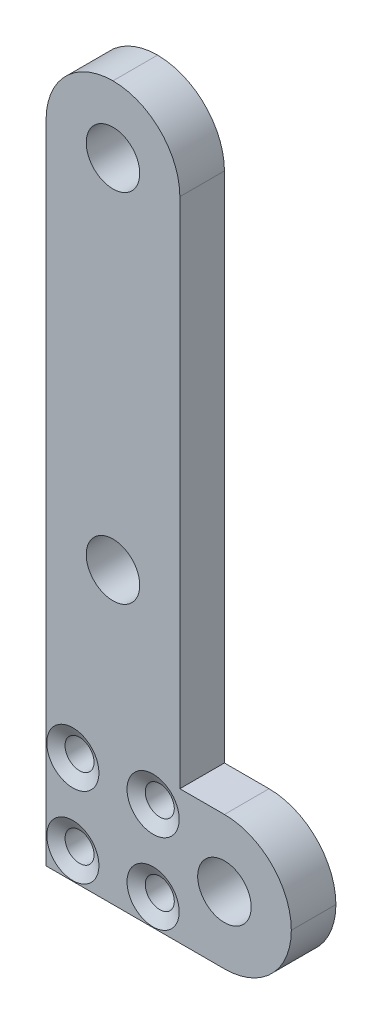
ISO-10303-21;
HEADER;
FILE_DESCRIPTION(('STEP AP214'),'2;1');
FILE_NAME('part.step','',(''),(''),'','','');
FILE_SCHEMA(('AUTOMOTIVE_DESIGN { 1 0 10303 214 1 1 1 1 }'));
ENDSEC;
DATA;
#1=APPLICATION_CONTEXT('core data for automotive mechanical design processes');
#2=APPLICATION_PROTOCOL_DEFINITION('international standard','automotive_design',2000,#1);
#3=PRODUCT_CONTEXT('',#1,'mechanical');
#4=PRODUCT('Part','Part','',(#3));
#5=PRODUCT_RELATED_PRODUCT_CATEGORY('part','',(#4));
#6=PRODUCT_DEFINITION_FORMATION('','',#4);
#7=PRODUCT_DEFINITION_CONTEXT('part definition',#1,'design');
#8=PRODUCT_DEFINITION('design','',#6,#7);
#9=PRODUCT_DEFINITION_SHAPE('','',#8);
#10=(LENGTH_UNIT() NAMED_UNIT(*) SI_UNIT(.MILLI.,.METRE.));
#11=(NAMED_UNIT(*) PLANE_ANGLE_UNIT() SI_UNIT($,.RADIAN.));
#12=(NAMED_UNIT(*) SI_UNIT($,.STERADIAN.) SOLID_ANGLE_UNIT());
#13=UNCERTAINTY_MEASURE_WITH_UNIT(LENGTH_MEASURE(1.E-05),#10,'distance_accuracy_value','');
#14=(GEOMETRIC_REPRESENTATION_CONTEXT(3) GLOBAL_UNCERTAINTY_ASSIGNED_CONTEXT((#13)) GLOBAL_UNIT_ASSIGNED_CONTEXT((#10,
#11,#12)) REPRESENTATION_CONTEXT('',''));
#15=CARTESIAN_POINT('',(0.,0.,0.));
#16=DIRECTION('',(0.,0.,1.));
#17=DIRECTION('',(1.,0.,0.));
#18=AXIS2_PLACEMENT_3D('',#15,#16,#17);
#19=CARTESIAN_POINT('',(-30.,0.,10.));
#20=DIRECTION('',(1.,0.,0.));
#21=DIRECTION('',(0.,1.,0.));
#22=AXIS2_PLACEMENT_3D('',#19,#20,#21);
#23=PLANE('',#22);
#24=DIRECTION('',(0.,-1.,0.));
#25=VECTOR('',#24,1.);
#26=CARTESIAN_POINT('',(-30.,0.,10.));
#27=LINE('',#26,#25);
#28=CARTESIAN_POINT('',(-30.,-15.,10.));
#29=VERTEX_POINT('',#28);
#30=CARTESIAN_POINT('',(-30.,-160.,10.));
#31=VERTEX_POINT('',#30);
#32=EDGE_CURVE('E102',#29,#31,#27,.T.);
#33=ORIENTED_EDGE('',*,*,#32,.F.);
#34=DIRECTION('',(0.,0.,-1.));
#35=VECTOR('',#34,1.);
#36=CARTESIAN_POINT('',(-30.,-15.,10.));
#37=LINE('',#36,#35);
#38=CARTESIAN_POINT('',(-30.,-15.,0.));
#39=VERTEX_POINT('',#38);
#40=EDGE_CURVE('E151',#29,#39,#37,.T.);
#41=ORIENTED_EDGE('',*,*,#40,.T.);
#42=DIRECTION('',(0.,-1.,0.));
#43=VECTOR('',#42,1.);
#44=CARTESIAN_POINT('',(-30.,0.,0.));
#45=LINE('',#44,#43);
#46=CARTESIAN_POINT('',(-30.,-160.,0.));
#47=VERTEX_POINT('',#46);
#48=EDGE_CURVE('E125',#39,#47,#45,.T.);
#49=ORIENTED_EDGE('',*,*,#48,.T.);
#50=DIRECTION('',(0.,0.,-1.));
#51=VECTOR('',#50,1.);
#52=CARTESIAN_POINT('',(-30.,-160.,10.));
#53=LINE('',#52,#51);
#54=EDGE_CURVE('E119',#31,#47,#53,.T.);
#55=ORIENTED_EDGE('',*,*,#54,.F.);
#56=EDGE_LOOP('',(#33,#41,#49,#55));
#57=FACE_BOUND('',#56,.T.);
#58=ADVANCED_FACE('F36',(#57),#23,.F.);
#59=CARTESIAN_POINT('',(25.,-160.,10.));
#60=DIRECTION('',(0.,1.,0.));
#61=DIRECTION('',(0.,0.,1.));
#62=AXIS2_PLACEMENT_3D('',#59,#60,#61);
#63=PLANE('',#62);
#64=DIRECTION('',(1.,0.,0.));
#65=VECTOR('',#64,1.);
#66=CARTESIAN_POINT('',(25.,-160.,0.));
#67=LINE('',#66,#65);
#68=CARTESIAN_POINT('',(10.,-160.,0.));
#69=VERTEX_POINT('',#68);
#70=EDGE_CURVE('E222',#47,#69,#67,.T.);
#71=ORIENTED_EDGE('',*,*,#70,.T.);
#72=DIRECTION('',(0.,0.,-1.));
#73=VECTOR('',#72,1.);
#74=CARTESIAN_POINT('',(10.,-160.,10.));
#75=LINE('',#74,#73);
#76=CARTESIAN_POINT('',(10.,-160.,10.));
#77=VERTEX_POINT('',#76);
#78=EDGE_CURVE('E121',#69,#77,#75,.F.);
#79=ORIENTED_EDGE('',*,*,#78,.T.);
#80=DIRECTION('',(1.,0.,0.));
#81=VECTOR('',#80,1.);
#82=CARTESIAN_POINT('',(25.,-160.,10.));
#83=LINE('',#82,#81);
#84=EDGE_CURVE('E105',#31,#77,#83,.T.);
#85=ORIENTED_EDGE('',*,*,#84,.F.);
#86=ORIENTED_EDGE('',*,*,#54,.T.);
#87=EDGE_LOOP('',(#71,#79,#85,#86));
#88=FACE_BOUND('',#87,.T.);
#89=ADVANCED_FACE('F118',(#88),#63,.F.);
#90=CARTESIAN_POINT('',(0.,-130.,10.));
#91=DIRECTION('',(0.,-1.,0.));
#92=DIRECTION('',(0.,0.,-1.));
#93=AXIS2_PLACEMENT_3D('',#90,#91,#92);
#94=PLANE('',#93);
#95=DIRECTION('',(-1.,0.,0.));
#96=VECTOR('',#95,1.);
#97=CARTESIAN_POINT('',(0.,-130.,10.));
#98=LINE('',#97,#96);
#99=CARTESIAN_POINT('',(10.,-130.,10.));
#100=VERTEX_POINT('',#99);
#101=CARTESIAN_POINT('',(0.,-130.,10.));
#102=VERTEX_POINT('',#101);
#103=EDGE_CURVE('E122',#100,#102,#98,.T.);
#104=ORIENTED_EDGE('',*,*,#103,.F.);
#105=DIRECTION('',(0.,0.,-1.));
#106=VECTOR('',#105,1.);
#107=CARTESIAN_POINT('',(10.,-130.,10.));
#108=LINE('',#107,#106);
#109=CARTESIAN_POINT('',(10.,-130.,0.));
#110=VERTEX_POINT('',#109);
#111=EDGE_CURVE('E149',#100,#110,#108,.T.);
#112=ORIENTED_EDGE('',*,*,#111,.T.);
#113=DIRECTION('',(-1.,0.,0.));
#114=VECTOR('',#113,1.);
#115=CARTESIAN_POINT('',(0.,-130.,0.));
#116=LINE('',#115,#114);
#117=CARTESIAN_POINT('',(0.,-130.,0.));
#118=VERTEX_POINT('',#117);
#119=EDGE_CURVE('E224',#110,#118,#116,.T.);
#120=ORIENTED_EDGE('',*,*,#119,.T.);
#121=DIRECTION('',(0.,0.,-1.));
#122=VECTOR('',#121,1.);
#123=CARTESIAN_POINT('',(0.,-130.,10.));
#124=LINE('',#123,#122);
#125=EDGE_CURVE('E128',#102,#118,#124,.T.);
#126=ORIENTED_EDGE('',*,*,#125,.F.);
#127=EDGE_LOOP('',(#104,#112,#120,#126));
#128=FACE_BOUND('',#127,.T.);
#129=ADVANCED_FACE('F245',(#128),#94,.F.);
#130=CARTESIAN_POINT('',(0.,0.,10.));
#131=DIRECTION('',(-1.,0.,0.));
#132=DIRECTION('',(0.,-1.,0.));
#133=AXIS2_PLACEMENT_3D('',#130,#131,#132);
#134=PLANE('',#133);
#135=DIRECTION('',(0.,1.,0.));
#136=VECTOR('',#135,1.);
#137=CARTESIAN_POINT('',(0.,0.,0.));
#138=LINE('',#137,#136);
#139=CARTESIAN_POINT('',(0.,-15.,0.));
#140=VERTEX_POINT('',#139);
#141=EDGE_CURVE('E112',#118,#140,#138,.T.);
#142=ORIENTED_EDGE('',*,*,#141,.T.);
#143=DIRECTION('',(0.,0.,-1.));
#144=VECTOR('',#143,1.);
#145=CARTESIAN_POINT('',(0.,-15.,10.));
#146=LINE('',#145,#144);
#147=CARTESIAN_POINT('',(0.,-15.,10.));
#148=VERTEX_POINT('',#147);
#149=EDGE_CURVE('E59',#140,#148,#146,.F.);
#150=ORIENTED_EDGE('',*,*,#149,.T.);
#151=DIRECTION('',(0.,1.,0.));
#152=VECTOR('',#151,1.);
#153=CARTESIAN_POINT('',(0.,0.,10.));
#154=LINE('',#153,#152);
#155=EDGE_CURVE('E133',#102,#148,#154,.T.);
#156=ORIENTED_EDGE('',*,*,#155,.F.);
#157=ORIENTED_EDGE('',*,*,#125,.T.);
#158=EDGE_LOOP('',(#142,#150,#156,#157));
#159=FACE_BOUND('',#158,.T.);
#160=ADVANCED_FACE('F194',(#159),#134,.F.);
#161=CARTESIAN_POINT('',(-30.,0.,10.));
#162=DIRECTION('',(0.,0.,-1.));
#163=DIRECTION('',(-1.,0.,0.));
#164=AXIS2_PLACEMENT_3D('',#161,#162,#163);
#165=PLANE('',#164);
#166=CARTESIAN_POINT('',(-5.99999999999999,-154.,10.));
#167=DIRECTION('',(0.,0.,-1.));
#168=DIRECTION('',(-1.,0.,0.));
#169=AXIS2_PLACEMENT_3D('',#166,#167,#168);
#170=CIRCLE('',#169,5.84807621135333);
#171=CARTESIAN_POINT('',(-11.8480762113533,-154.,10.));
#172=VERTEX_POINT('',#171);
#173=EDGE_CURVE('E171',#172,#172,#170,.T.);
#174=ORIENTED_EDGE('',*,*,#173,.T.);
#175=EDGE_LOOP('',(#174));
#176=FACE_BOUND('',#175,.T.);
#177=CARTESIAN_POINT('',(-24.,-154.,10.));
#178=DIRECTION('',(0.,0.,-1.));
#179=DIRECTION('',(-1.,0.,0.));
#180=AXIS2_PLACEMENT_3D('',#177,#178,#179);
#181=CIRCLE('',#180,5.8480762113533);
#182=CARTESIAN_POINT('',(-29.8480762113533,-154.,10.));
#183=VERTEX_POINT('',#182);
#184=EDGE_CURVE('E168',#183,#183,#181,.T.);
#185=ORIENTED_EDGE('',*,*,#184,.T.);
#186=EDGE_LOOP('',(#185));
#187=FACE_BOUND('',#186,.T.);
#188=CARTESIAN_POINT('',(-24.,-136.,10.));
#189=DIRECTION('',(0.,0.,-1.));
#190=DIRECTION('',(-1.,0.,0.));
#191=AXIS2_PLACEMENT_3D('',#188,#189,#190);
#192=CIRCLE('',#191,5.8480762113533);
#193=CARTESIAN_POINT('',(-29.8480762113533,-136.,10.));
#194=VERTEX_POINT('',#193);
#195=EDGE_CURVE('E165',#194,#194,#192,.T.);
#196=ORIENTED_EDGE('',*,*,#195,.T.);
#197=EDGE_LOOP('',(#196));
#198=FACE_BOUND('',#197,.T.);
#199=CARTESIAN_POINT('',(-6.,-136.,10.));
#200=DIRECTION('',(0.,0.,-1.));
#201=DIRECTION('',(-1.,0.,0.));
#202=AXIS2_PLACEMENT_3D('',#199,#200,#201);
#203=CIRCLE('',#202,5.84807621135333);
#204=CARTESIAN_POINT('',(-11.8480762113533,-136.,10.));
#205=VERTEX_POINT('',#204);
#206=EDGE_CURVE('E154',#205,#205,#203,.T.);
#207=ORIENTED_EDGE('',*,*,#206,.T.);
#208=EDGE_LOOP('',(#207));
#209=FACE_BOUND('',#208,.T.);
#210=CARTESIAN_POINT('',(-15.,-95.,10.));
#211=DIRECTION('',(0.,0.,1.));
#212=DIRECTION('',(1.,0.,0.));
#213=AXIS2_PLACEMENT_3D('',#210,#211,#212);
#214=CIRCLE('',#213,6.);
#215=CARTESIAN_POINT('',(-8.99999999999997,-95.,10.));
#216=VERTEX_POINT('',#215);
#217=EDGE_CURVE('E158',#216,#216,#214,.T.);
#218=ORIENTED_EDGE('',*,*,#217,.F.);
#219=EDGE_LOOP('',(#218));
#220=FACE_BOUND('',#219,.T.);
#221=CARTESIAN_POINT('',(-15.,-15.,10.));
#222=DIRECTION('',(0.,0.,1.));
#223=DIRECTION('',(1.,0.,0.));
#224=AXIS2_PLACEMENT_3D('',#221,#222,#223);
#225=CIRCLE('',#224,6.);
#226=CARTESIAN_POINT('',(-8.99999999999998,-15.,10.));
#227=VERTEX_POINT('',#226);
#228=EDGE_CURVE('E205',#227,#227,#225,.T.);
#229=ORIENTED_EDGE('',*,*,#228,.F.);
#230=EDGE_LOOP('',(#229));
#231=FACE_BOUND('',#230,.T.);
#232=CARTESIAN_POINT('',(10.,-145.,10.));
#233=DIRECTION('',(0.,0.,1.));
#234=DIRECTION('',(1.,0.,0.));
#235=AXIS2_PLACEMENT_3D('',#232,#233,#234);
#236=CIRCLE('',#235,6.);
#237=CARTESIAN_POINT('',(16.,-145.,10.));
#238=VERTEX_POINT('',#237);
#239=EDGE_CURVE('E208',#238,#238,#236,.T.);
#240=ORIENTED_EDGE('',*,*,#239,.F.);
#241=EDGE_LOOP('',(#240));
#242=FACE_BOUND('',#241,.T.);
#243=ORIENTED_EDGE('',*,*,#84,.T.);
#244=CARTESIAN_POINT('',(10.,-145.,10.));
#245=DIRECTION('',(0.,0.,-1.));
#246=DIRECTION('',(-1.,0.,0.));
#247=AXIS2_PLACEMENT_3D('',#244,#245,#246);
#248=CIRCLE('',#247,15.);
#249=CARTESIAN_POINT('',(25.,-145.,10.));
#250=VERTEX_POINT('',#249);
#251=EDGE_CURVE('E147',#77,#250,#248,.F.);
#252=ORIENTED_EDGE('',*,*,#251,.T.);
#253=CARTESIAN_POINT('',(10.,-145.,10.));
#254=DIRECTION('',(0.,0.,-1.));
#255=DIRECTION('',(-1.,0.,0.));
#256=AXIS2_PLACEMENT_3D('',#253,#254,#255);
#257=CIRCLE('',#256,15.);
#258=EDGE_CURVE('E145',#250,#100,#257,.F.);
#259=ORIENTED_EDGE('',*,*,#258,.T.);
#260=ORIENTED_EDGE('',*,*,#103,.T.);
#261=ORIENTED_EDGE('',*,*,#155,.T.);
#262=CARTESIAN_POINT('',(-15.,-15.,10.));
#263=DIRECTION('',(0.,0.,-1.));
#264=DIRECTION('',(-1.,0.,0.));
#265=AXIS2_PLACEMENT_3D('',#262,#263,#264);
#266=CIRCLE('',#265,15.);
#267=CARTESIAN_POINT('',(-15.,0.,10.));
#268=VERTEX_POINT('',#267);
#269=EDGE_CURVE('E51',#148,#268,#266,.F.);
#270=ORIENTED_EDGE('',*,*,#269,.T.);
#271=CARTESIAN_POINT('',(-15.,-15.,10.));
#272=DIRECTION('',(0.,0.,-1.));
#273=DIRECTION('',(-1.,0.,0.));
#274=AXIS2_PLACEMENT_3D('',#271,#272,#273);
#275=CIRCLE('',#274,15.);
#276=EDGE_CURVE('E107',#268,#29,#275,.F.);
#277=ORIENTED_EDGE('',*,*,#276,.T.);
#278=ORIENTED_EDGE('',*,*,#32,.T.);
#279=EDGE_LOOP('',(#243,#252,#259,#260,#261,#270,#277,#278));
#280=FACE_BOUND('',#279,.T.);
#281=ADVANCED_FACE('F104',(#176,#187,#198,#209,#220,#231,#242,#280),#165,.F.);
#282=CARTESIAN_POINT('',(-30.,0.,0.));
#283=DIRECTION('',(0.,0.,-1.));
#284=DIRECTION('',(-1.,0.,0.));
#285=AXIS2_PLACEMENT_3D('',#282,#283,#284);
#286=PLANE('',#285);
#287=CARTESIAN_POINT('',(-6.,-136.,0.));
#288=DIRECTION('',(0.,0.,-1.));
#289=DIRECTION('',(-1.,0.,0.));
#290=AXIS2_PLACEMENT_3D('',#287,#288,#289);
#291=CIRCLE('',#290,3.25);
#292=CARTESIAN_POINT('',(-9.25,-136.,0.));
#293=VERTEX_POINT('',#292);
#294=EDGE_CURVE('E323',#293,#293,#291,.T.);
#295=ORIENTED_EDGE('',*,*,#294,.F.);
#296=EDGE_LOOP('',(#295));
#297=FACE_BOUND('',#296,.T.);
#298=CARTESIAN_POINT('',(-24.,-136.,0.));
#299=DIRECTION('',(0.,0.,-1.));
#300=DIRECTION('',(-1.,0.,0.));
#301=AXIS2_PLACEMENT_3D('',#298,#299,#300);
#302=CIRCLE('',#301,3.25);
#303=CARTESIAN_POINT('',(-27.25,-136.,0.));
#304=VERTEX_POINT('',#303);
#305=EDGE_CURVE('E293',#304,#304,#302,.T.);
#306=ORIENTED_EDGE('',*,*,#305,.F.);
#307=EDGE_LOOP('',(#306));
#308=FACE_BOUND('',#307,.T.);
#309=CARTESIAN_POINT('',(-5.99999999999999,-154.,0.));
#310=DIRECTION('',(0.,0.,-1.));
#311=DIRECTION('',(-1.,0.,0.));
#312=AXIS2_PLACEMENT_3D('',#309,#310,#311);
#313=CIRCLE('',#312,3.25);
#314=CARTESIAN_POINT('',(-9.25,-154.,0.));
#315=VERTEX_POINT('',#314);
#316=EDGE_CURVE('E290',#315,#315,#313,.T.);
#317=ORIENTED_EDGE('',*,*,#316,.F.);
#318=EDGE_LOOP('',(#317));
#319=FACE_BOUND('',#318,.T.);
#320=CARTESIAN_POINT('',(-24.,-154.,0.));
#321=DIRECTION('',(0.,0.,-1.));
#322=DIRECTION('',(-1.,0.,0.));
#323=AXIS2_PLACEMENT_3D('',#320,#321,#322);
#324=CIRCLE('',#323,3.25);
#325=CARTESIAN_POINT('',(-27.25,-154.,0.));
#326=VERTEX_POINT('',#325);
#327=EDGE_CURVE('E162',#326,#326,#324,.T.);
#328=ORIENTED_EDGE('',*,*,#327,.F.);
#329=EDGE_LOOP('',(#328));
#330=FACE_BOUND('',#329,.T.);
#331=CARTESIAN_POINT('',(-15.,-95.,0.));
#332=DIRECTION('',(0.,0.,1.));
#333=DIRECTION('',(1.,0.,0.));
#334=AXIS2_PLACEMENT_3D('',#331,#332,#333);
#335=CIRCLE('',#334,6.);
#336=CARTESIAN_POINT('',(-8.99999999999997,-95.,0.));
#337=VERTEX_POINT('',#336);
#338=EDGE_CURVE('E297',#337,#337,#335,.T.);
#339=ORIENTED_EDGE('',*,*,#338,.T.);
#340=EDGE_LOOP('',(#339));
#341=FACE_BOUND('',#340,.T.);
#342=CARTESIAN_POINT('',(-15.,-15.,0.));
#343=DIRECTION('',(0.,0.,1.));
#344=DIRECTION('',(1.,0.,0.));
#345=AXIS2_PLACEMENT_3D('',#342,#343,#344);
#346=CIRCLE('',#345,6.);
#347=CARTESIAN_POINT('',(-8.99999999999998,-15.,0.));
#348=VERTEX_POINT('',#347);
#349=EDGE_CURVE('E211',#348,#348,#346,.T.);
#350=ORIENTED_EDGE('',*,*,#349,.T.);
#351=EDGE_LOOP('',(#350));
#352=FACE_BOUND('',#351,.T.);
#353=CARTESIAN_POINT('',(10.,-145.,0.));
#354=DIRECTION('',(0.,0.,1.));
#355=DIRECTION('',(1.,0.,0.));
#356=AXIS2_PLACEMENT_3D('',#353,#354,#355);
#357=CIRCLE('',#356,6.);
#358=CARTESIAN_POINT('',(16.,-145.,0.));
#359=VERTEX_POINT('',#358);
#360=EDGE_CURVE('E210',#359,#359,#357,.T.);
#361=ORIENTED_EDGE('',*,*,#360,.T.);
#362=EDGE_LOOP('',(#361));
#363=FACE_BOUND('',#362,.T.);
#364=CARTESIAN_POINT('',(10.,-145.,0.));
#365=DIRECTION('',(0.,0.,-1.));
#366=DIRECTION('',(-1.,0.,0.));
#367=AXIS2_PLACEMENT_3D('',#364,#365,#366);
#368=CIRCLE('',#367,15.);
#369=CARTESIAN_POINT('',(25.,-145.,0.));
#370=VERTEX_POINT('',#369);
#371=EDGE_CURVE('E138',#110,#370,#368,.T.);
#372=ORIENTED_EDGE('',*,*,#371,.T.);
#373=CARTESIAN_POINT('',(10.,-145.,0.));
#374=DIRECTION('',(0.,0.,-1.));
#375=DIRECTION('',(-1.,0.,0.));
#376=AXIS2_PLACEMENT_3D('',#373,#374,#375);
#377=CIRCLE('',#376,15.);
#378=EDGE_CURVE('E140',#370,#69,#377,.T.);
#379=ORIENTED_EDGE('',*,*,#378,.T.);
#380=ORIENTED_EDGE('',*,*,#70,.F.);
#381=ORIENTED_EDGE('',*,*,#48,.F.);
#382=CARTESIAN_POINT('',(-15.,-15.,0.));
#383=DIRECTION('',(0.,0.,-1.));
#384=DIRECTION('',(-1.,0.,0.));
#385=AXIS2_PLACEMENT_3D('',#382,#383,#384);
#386=CIRCLE('',#385,15.);
#387=CARTESIAN_POINT('',(-15.,0.,0.));
#388=VERTEX_POINT('',#387);
#389=EDGE_CURVE('E130',#39,#388,#386,.T.);
#390=ORIENTED_EDGE('',*,*,#389,.T.);
#391=CARTESIAN_POINT('',(-15.,-15.,0.));
#392=DIRECTION('',(0.,0.,-1.));
#393=DIRECTION('',(-1.,0.,0.));
#394=AXIS2_PLACEMENT_3D('',#391,#392,#393);
#395=CIRCLE('',#394,15.);
#396=EDGE_CURVE('E127',#388,#140,#395,.T.);
#397=ORIENTED_EDGE('',*,*,#396,.T.);
#398=ORIENTED_EDGE('',*,*,#141,.F.);
#399=ORIENTED_EDGE('',*,*,#119,.F.);
#400=EDGE_LOOP('',(#372,#379,#380,#381,#390,#397,#398,#399));
#401=FACE_BOUND('',#400,.T.);
#402=ADVANCED_FACE('F193',(#297,#308,#319,#330,#341,#352,#363,#401),#286,.T.);
#403=CARTESIAN_POINT('',(10.,-145.,0.));
#404=DIRECTION('',(0.,0.,1.));
#405=DIRECTION('',(1.,0.,0.));
#406=AXIS2_PLACEMENT_3D('',#403,#404,#405);
#407=CYLINDRICAL_SURFACE('',#406,6.);
#408=ORIENTED_EDGE('',*,*,#360,.F.);
#409=EDGE_LOOP('',(#408));
#410=FACE_BOUND('',#409,.T.);
#411=ORIENTED_EDGE('',*,*,#239,.T.);
#412=EDGE_LOOP('',(#411));
#413=FACE_BOUND('',#412,.T.);
#414=ADVANCED_FACE('F303',(#410,#413),#407,.F.);
#415=CARTESIAN_POINT('',(-15.,-15.,0.));
#416=DIRECTION('',(0.,0.,1.));
#417=DIRECTION('',(1.,0.,0.));
#418=AXIS2_PLACEMENT_3D('',#415,#416,#417);
#419=CYLINDRICAL_SURFACE('',#418,6.);
#420=ORIENTED_EDGE('',*,*,#349,.F.);
#421=EDGE_LOOP('',(#420));
#422=FACE_BOUND('',#421,.T.);
#423=ORIENTED_EDGE('',*,*,#228,.T.);
#424=EDGE_LOOP('',(#423));
#425=FACE_BOUND('',#424,.T.);
#426=ADVANCED_FACE('F301',(#422,#425),#419,.F.);
#427=CARTESIAN_POINT('',(-15.,-95.,0.));
#428=DIRECTION('',(0.,0.,1.));
#429=DIRECTION('',(1.,0.,0.));
#430=AXIS2_PLACEMENT_3D('',#427,#428,#429);
#431=CYLINDRICAL_SURFACE('',#430,6.);
#432=ORIENTED_EDGE('',*,*,#338,.F.);
#433=EDGE_LOOP('',(#432));
#434=FACE_BOUND('',#433,.T.);
#435=ORIENTED_EDGE('',*,*,#217,.T.);
#436=EDGE_LOOP('',(#435));
#437=FACE_BOUND('',#436,.T.);
#438=ADVANCED_FACE('F263',(#434,#437),#431,.F.);
#439=CARTESIAN_POINT('',(10.,-145.,10.));
#440=DIRECTION('',(0.,0.,-1.));
#441=DIRECTION('',(-1.,0.,0.));
#442=AXIS2_PLACEMENT_3D('',#439,#440,#441);
#443=CYLINDRICAL_SURFACE('',#442,15.);
#444=ORIENTED_EDGE('',*,*,#111,.F.);
#445=ORIENTED_EDGE('',*,*,#258,.F.);
#446=DIRECTION('',(0.,0.,-1.));
#447=VECTOR('',#446,1.);
#448=CARTESIAN_POINT('',(25.,-145.,10.));
#449=LINE('',#448,#447);
#450=EDGE_CURVE('E155',#370,#250,#449,.F.);
#451=ORIENTED_EDGE('',*,*,#450,.F.);
#452=ORIENTED_EDGE('',*,*,#371,.F.);
#453=EDGE_LOOP('',(#444,#445,#451,#452));
#454=FACE_BOUND('',#453,.T.);
#455=ADVANCED_FACE('F242',(#454),#443,.T.);
#456=CARTESIAN_POINT('',(10.,-145.,10.));
#457=DIRECTION('',(0.,0.,-1.));
#458=DIRECTION('',(-1.,0.,0.));
#459=AXIS2_PLACEMENT_3D('',#456,#457,#458);
#460=CYLINDRICAL_SURFACE('',#459,15.);
#461=ORIENTED_EDGE('',*,*,#251,.F.);
#462=ORIENTED_EDGE('',*,*,#78,.F.);
#463=ORIENTED_EDGE('',*,*,#378,.F.);
#464=ORIENTED_EDGE('',*,*,#450,.T.);
#465=EDGE_LOOP('',(#461,#462,#463,#464));
#466=FACE_BOUND('',#465,.T.);
#467=ADVANCED_FACE('F236',(#466),#460,.T.);
#468=CARTESIAN_POINT('',(-15.,-15.,10.));
#469=DIRECTION('',(0.,0.,-1.));
#470=DIRECTION('',(-1.,0.,0.));
#471=AXIS2_PLACEMENT_3D('',#468,#469,#470);
#472=CYLINDRICAL_SURFACE('',#471,15.);
#473=DIRECTION('',(0.,0.,-1.));
#474=VECTOR('',#473,1.);
#475=CARTESIAN_POINT('',(-15.,0.,10.));
#476=LINE('',#475,#474);
#477=EDGE_CURVE('E159',#268,#388,#476,.T.);
#478=ORIENTED_EDGE('',*,*,#477,.F.);
#479=ORIENTED_EDGE('',*,*,#269,.F.);
#480=ORIENTED_EDGE('',*,*,#149,.F.);
#481=ORIENTED_EDGE('',*,*,#396,.F.);
#482=EDGE_LOOP('',(#478,#479,#480,#481));
#483=FACE_BOUND('',#482,.T.);
#484=ADVANCED_FACE('F231',(#483),#472,.T.);
#485=CARTESIAN_POINT('',(-15.,-15.,10.));
#486=DIRECTION('',(0.,0.,-1.));
#487=DIRECTION('',(-1.,0.,0.));
#488=AXIS2_PLACEMENT_3D('',#485,#486,#487);
#489=CYLINDRICAL_SURFACE('',#488,15.);
#490=ORIENTED_EDGE('',*,*,#276,.F.);
#491=ORIENTED_EDGE('',*,*,#477,.T.);
#492=ORIENTED_EDGE('',*,*,#389,.F.);
#493=ORIENTED_EDGE('',*,*,#40,.F.);
#494=EDGE_LOOP('',(#490,#491,#492,#493));
#495=FACE_BOUND('',#494,.T.);
#496=ADVANCED_FACE('F233',(#495),#489,.T.);
#497=CARTESIAN_POINT('',(-24.,-154.,10.));
#498=DIRECTION('',(0.,0.,-1.));
#499=DIRECTION('',(-1.,0.,0.));
#500=AXIS2_PLACEMENT_3D('',#497,#498,#499);
#501=CYLINDRICAL_SURFACE('',#500,3.25);
#502=CARTESIAN_POINT('',(-24.,-154.,8.5));
#503=DIRECTION('',(0.,0.,-1.));
#504=DIRECTION('',(-1.,0.,0.));
#505=AXIS2_PLACEMENT_3D('',#502,#503,#504);
#506=CIRCLE('',#505,3.25);
#507=CARTESIAN_POINT('',(-27.25,-154.,8.5));
#508=VERTEX_POINT('',#507);
#509=EDGE_CURVE('E177',#508,#508,#506,.F.);
#510=ORIENTED_EDGE('',*,*,#509,.T.);
#511=EDGE_LOOP('',(#510));
#512=FACE_BOUND('',#511,.T.);
#513=ORIENTED_EDGE('',*,*,#327,.T.);
#514=EDGE_LOOP('',(#513));
#515=FACE_BOUND('',#514,.T.);
#516=ADVANCED_FACE('F266',(#512,#515),#501,.F.);
#517=CARTESIAN_POINT('',(-5.99999999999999,-154.,10.));
#518=DIRECTION('',(0.,0.,-1.));
#519=DIRECTION('',(-1.,0.,0.));
#520=AXIS2_PLACEMENT_3D('',#517,#518,#519);
#521=CYLINDRICAL_SURFACE('',#520,3.25);
#522=CARTESIAN_POINT('',(-5.99999999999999,-154.,8.49999999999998));
#523=DIRECTION('',(0.,0.,-1.));
#524=DIRECTION('',(-1.,0.,0.));
#525=AXIS2_PLACEMENT_3D('',#522,#523,#524);
#526=CIRCLE('',#525,3.25);
#527=CARTESIAN_POINT('',(-9.25,-154.,8.49999999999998));
#528=VERTEX_POINT('',#527);
#529=EDGE_CURVE('E174',#528,#528,#526,.F.);
#530=ORIENTED_EDGE('',*,*,#529,.T.);
#531=EDGE_LOOP('',(#530));
#532=FACE_BOUND('',#531,.T.);
#533=ORIENTED_EDGE('',*,*,#316,.T.);
#534=EDGE_LOOP('',(#533));
#535=FACE_BOUND('',#534,.T.);
#536=ADVANCED_FACE('F285',(#532,#535),#521,.F.);
#537=CARTESIAN_POINT('',(-24.,-136.,10.));
#538=DIRECTION('',(0.,0.,-1.));
#539=DIRECTION('',(-1.,0.,0.));
#540=AXIS2_PLACEMENT_3D('',#537,#538,#539);
#541=CYLINDRICAL_SURFACE('',#540,3.25);
#542=CARTESIAN_POINT('',(-24.,-136.,8.5));
#543=DIRECTION('',(0.,0.,-1.));
#544=DIRECTION('',(-1.,0.,0.));
#545=AXIS2_PLACEMENT_3D('',#542,#543,#544);
#546=CIRCLE('',#545,3.25);
#547=CARTESIAN_POINT('',(-27.25,-136.,8.5));
#548=VERTEX_POINT('',#547);
#549=EDGE_CURVE('E44',#548,#548,#546,.F.);
#550=ORIENTED_EDGE('',*,*,#549,.T.);
#551=EDGE_LOOP('',(#550));
#552=FACE_BOUND('',#551,.T.);
#553=ORIENTED_EDGE('',*,*,#305,.T.);
#554=EDGE_LOOP('',(#553));
#555=FACE_BOUND('',#554,.T.);
#556=ADVANCED_FACE('F182',(#552,#555),#541,.F.);
#557=CARTESIAN_POINT('',(-6.,-136.,10.));
#558=DIRECTION('',(0.,0.,-1.));
#559=DIRECTION('',(-1.,0.,0.));
#560=AXIS2_PLACEMENT_3D('',#557,#558,#559);
#561=CYLINDRICAL_SURFACE('',#560,3.25);
#562=CARTESIAN_POINT('',(-6.,-136.,8.49999999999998));
#563=DIRECTION('',(0.,0.,-1.));
#564=DIRECTION('',(-1.,0.,0.));
#565=AXIS2_PLACEMENT_3D('',#562,#563,#564);
#566=CIRCLE('',#565,3.25);
#567=CARTESIAN_POINT('',(-9.25,-136.,8.49999999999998));
#568=VERTEX_POINT('',#567);
#569=EDGE_CURVE('E11',#568,#568,#566,.F.);
#570=ORIENTED_EDGE('',*,*,#569,.T.);
#571=EDGE_LOOP('',(#570));
#572=FACE_BOUND('',#571,.T.);
#573=ORIENTED_EDGE('',*,*,#294,.T.);
#574=EDGE_LOOP('',(#573));
#575=FACE_BOUND('',#574,.T.);
#576=ADVANCED_FACE('F272',(#572,#575),#561,.F.);
#577=CARTESIAN_POINT('',(-5.99999999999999,-154.,10.));
#578=DIRECTION('',(0.,0.,1.));
#579=DIRECTION('',(1.,0.,0.));
#580=AXIS2_PLACEMENT_3D('',#577,#578,#579);
#581=CONICAL_SURFACE('',#580,5.84807621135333,1.04719755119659);
#582=ORIENTED_EDGE('',*,*,#529,.F.);
#583=EDGE_LOOP('',(#582));
#584=FACE_BOUND('',#583,.T.);
#585=ORIENTED_EDGE('',*,*,#173,.F.);
#586=EDGE_LOOP('',(#585));
#587=FACE_BOUND('',#586,.T.);
#588=ADVANCED_FACE('F269',(#584,#587),#581,.F.);
#589=CARTESIAN_POINT('',(-24.,-154.,10.));
#590=DIRECTION('',(0.,0.,1.));
#591=DIRECTION('',(1.,0.,0.));
#592=AXIS2_PLACEMENT_3D('',#589,#590,#591);
#593=CONICAL_SURFACE('',#592,5.8480762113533,1.04719755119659);
#594=ORIENTED_EDGE('',*,*,#509,.F.);
#595=EDGE_LOOP('',(#594));
#596=FACE_BOUND('',#595,.T.);
#597=ORIENTED_EDGE('',*,*,#184,.F.);
#598=EDGE_LOOP('',(#597));
#599=FACE_BOUND('',#598,.T.);
#600=ADVANCED_FACE('F188',(#596,#599),#593,.F.);
#601=CARTESIAN_POINT('',(-24.,-136.,10.));
#602=DIRECTION('',(0.,0.,1.));
#603=DIRECTION('',(1.,0.,0.));
#604=AXIS2_PLACEMENT_3D('',#601,#602,#603);
#605=CONICAL_SURFACE('',#604,5.8480762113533,1.04719755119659);
#606=ORIENTED_EDGE('',*,*,#549,.F.);
#607=EDGE_LOOP('',(#606));
#608=FACE_BOUND('',#607,.T.);
#609=ORIENTED_EDGE('',*,*,#195,.F.);
#610=EDGE_LOOP('',(#609));
#611=FACE_BOUND('',#610,.T.);
#612=ADVANCED_FACE('F185',(#608,#611),#605,.F.);
#613=CARTESIAN_POINT('',(-6.,-136.,10.));
#614=DIRECTION('',(0.,0.,1.));
#615=DIRECTION('',(1.,0.,0.));
#616=AXIS2_PLACEMENT_3D('',#613,#614,#615);
#617=CONICAL_SURFACE('',#616,5.84807621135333,1.04719755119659);
#618=ORIENTED_EDGE('',*,*,#569,.F.);
#619=EDGE_LOOP('',(#618));
#620=FACE_BOUND('',#619,.T.);
#621=ORIENTED_EDGE('',*,*,#206,.F.);
#622=EDGE_LOOP('',(#621));
#623=FACE_BOUND('',#622,.T.);
#624=ADVANCED_FACE('F38',(#620,#623),#617,.F.);
#625=CLOSED_SHELL('',(#58,#89,#129,#160,#281,#402,#414,#426,#438,#455,#467,#484,#496,#516,#536,
#556,#576,#588,#600,#612,#624));
#626=MANIFOLD_SOLID_BREP('B2',#625);
#627=ADVANCED_BREP_SHAPE_REPRESENTATION('',(#18,#626),#14);
#628=SHAPE_DEFINITION_REPRESENTATION(#9,#627);
ENDSEC;
END-ISO-10303-21;
